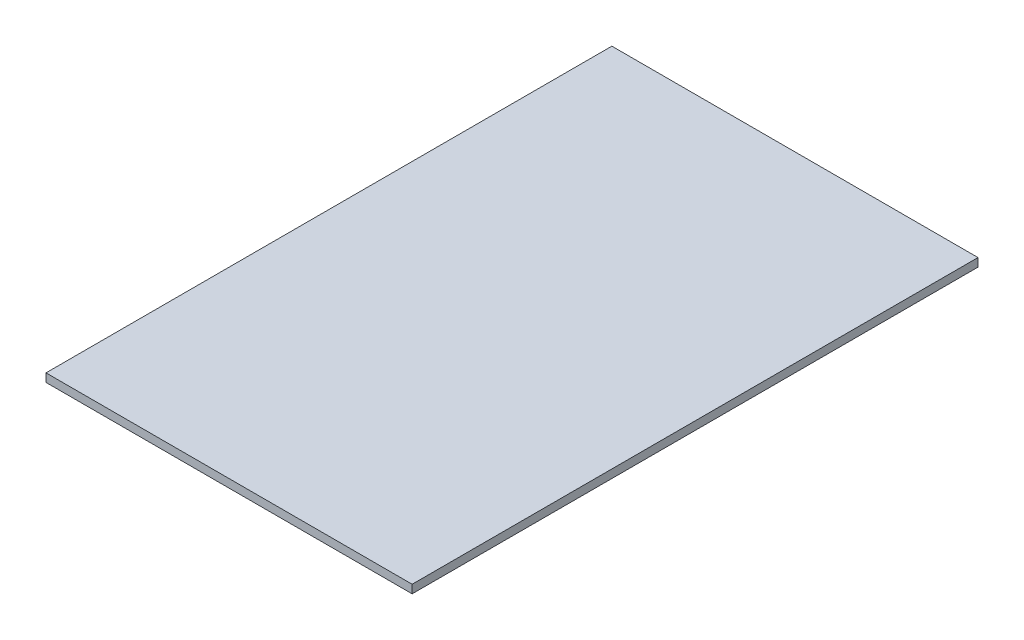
from build123d import *

# Parameters (mm, degrees)
SKETCH1_W           = 139.7
SKETCH1_H           = 215.9
BOSS_EXTRUDE1_DEPTH = 3.175


with BuildPart() as part:
    # Sketch1 → Boss-Extrude1 (new body)
    with BuildSketch(Plane(origin=(0, 3.175, 0), x_dir=(-1, 0, 0), z_dir=(0, 1, 0))):
        with Locations((-69.85, -107.95)):
            Rectangle(SKETCH1_W, SKETCH1_H)
    extrude(amount=-BOSS_EXTRUDE1_DEPTH)


solid = part.part
